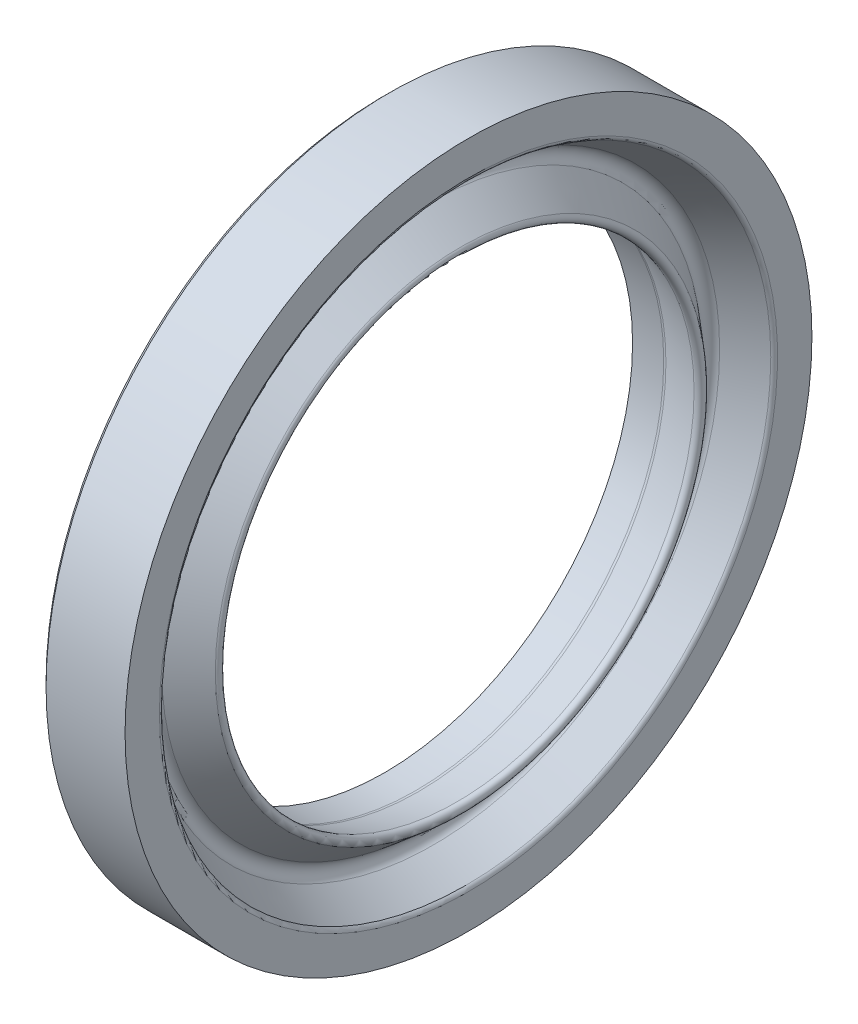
ISO-10303-21;
HEADER;
FILE_DESCRIPTION(('STEP AP214'),'2;1');
FILE_NAME('part.step','',(''),(''),'','','');
FILE_SCHEMA(('AUTOMOTIVE_DESIGN { 1 0 10303 214 1 1 1 1 }'));
ENDSEC;
DATA;
#1=APPLICATION_CONTEXT('core data for automotive mechanical design processes');
#2=APPLICATION_PROTOCOL_DEFINITION('international standard','automotive_design',2000,#1);
#3=PRODUCT_CONTEXT('',#1,'mechanical');
#4=PRODUCT('Part','Part','',(#3));
#5=PRODUCT_RELATED_PRODUCT_CATEGORY('part','',(#4));
#6=PRODUCT_DEFINITION_FORMATION('','',#4);
#7=PRODUCT_DEFINITION_CONTEXT('part definition',#1,'design');
#8=PRODUCT_DEFINITION('design','',#6,#7);
#9=PRODUCT_DEFINITION_SHAPE('','',#8);
#10=(LENGTH_UNIT() NAMED_UNIT(*) SI_UNIT(.MILLI.,.METRE.));
#11=(NAMED_UNIT(*) PLANE_ANGLE_UNIT() SI_UNIT($,.RADIAN.));
#12=(NAMED_UNIT(*) SI_UNIT($,.STERADIAN.) SOLID_ANGLE_UNIT());
#13=UNCERTAINTY_MEASURE_WITH_UNIT(LENGTH_MEASURE(1.E-05),#10,'distance_accuracy_value','');
#14=(GEOMETRIC_REPRESENTATION_CONTEXT(3) GLOBAL_UNCERTAINTY_ASSIGNED_CONTEXT((#13)) GLOBAL_UNIT_ASSIGNED_CONTEXT((#10,
#11,#12)) REPRESENTATION_CONTEXT('',''));
#15=CARTESIAN_POINT('',(0.,0.,0.));
#16=DIRECTION('',(0.,0.,1.));
#17=DIRECTION('',(1.,0.,0.));
#18=AXIS2_PLACEMENT_3D('',#15,#16,#17);
#19=CARTESIAN_POINT('',(10.3553652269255,0.,0.));
#20=DIRECTION('',(-1.,0.,0.));
#21=DIRECTION('',(0.,0.,1.));
#22=AXIS2_PLACEMENT_3D('',#19,#20,#21);
#23=TOROIDAL_SURFACE('',#22,40.4953832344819,0.644634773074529);
#24=CARTESIAN_POINT('',(10.6719865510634,0.,0.));
#25=DIRECTION('',(-1.,0.,0.));
#26=DIRECTION('',(0.,0.,1.));
#27=AXIS2_PLACEMENT_3D('',#24,#25,#26);
#28=CIRCLE('',#27,39.9338630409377);
#29=CARTESIAN_POINT('',(10.6719865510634,0.,39.9338630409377));
#30=VERTEX_POINT('',#29);
#31=EDGE_CURVE('E10',#30,#30,#28,.T.);
#32=ORIENTED_EDGE('',*,*,#31,.T.);
#33=EDGE_LOOP('',(#32));
#34=FACE_BOUND('',#33,.T.);
#35=CARTESIAN_POINT('',(11.,0.,0.));
#36=DIRECTION('',(-1.,0.,0.));
#37=DIRECTION('',(0.,0.,1.));
#38=AXIS2_PLACEMENT_3D('',#35,#36,#37);
#39=CIRCLE('',#38,40.4953832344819);
#40=CARTESIAN_POINT('',(11.,0.,40.4953832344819));
#41=VERTEX_POINT('',#40);
#42=EDGE_CURVE('E71',#41,#41,#39,.T.);
#43=ORIENTED_EDGE('',*,*,#42,.F.);
#44=EDGE_LOOP('',(#43));
#45=FACE_BOUND('',#44,.T.);
#46=ADVANCED_FACE('F31',(#34,#45),#23,.T.);
#47=CARTESIAN_POINT('',(10.6719865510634,0.,0.));
#48=DIRECTION('',(1.,0.,0.));
#49=DIRECTION('',(0.,0.,-1.));
#50=AXIS2_PLACEMENT_3D('',#47,#48,#49);
#51=CONICAL_SURFACE('',#50,39.9338630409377,0.513425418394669);
#52=CARTESIAN_POINT('',(6.38738178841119,0.,0.));
#53=DIRECTION('',(-1.,0.,0.));
#54=DIRECTION('',(0.,0.,1.));
#55=AXIS2_PLACEMENT_3D('',#52,#53,#54);
#56=CIRCLE('',#55,37.5179263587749);
#57=CARTESIAN_POINT('',(6.38738178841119,0.,37.5179263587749));
#58=VERTEX_POINT('',#57);
#59=EDGE_CURVE('E37',#58,#58,#56,.T.);
#60=ORIENTED_EDGE('',*,*,#59,.T.);
#61=EDGE_LOOP('',(#60));
#62=FACE_BOUND('',#61,.T.);
#63=ORIENTED_EDGE('',*,*,#31,.F.);
#64=EDGE_LOOP('',(#63));
#65=FACE_BOUND('',#64,.T.);
#66=ADVANCED_FACE('F79',(#62,#65),#51,.F.);
#67=CARTESIAN_POINT('',(7.02589484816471,0.,0.));
#68=DIRECTION('',(-1.,0.,0.));
#69=DIRECTION('',(0.,0.,1.));
#70=AXIS2_PLACEMENT_3D('',#67,#68,#69);
#71=TOROIDAL_SURFACE('',#70,36.3855390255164,1.29999999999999);
#72=CARTESIAN_POINT('',(6.1902709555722,0.,0.));
#73=DIRECTION('',(-1.,0.,0.));
#74=DIRECTION('',(0.,0.,1.));
#75=AXIS2_PLACEMENT_3D('',#72,#73,#74);
#76=CIRCLE('',#75,35.3896812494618);
#77=CARTESIAN_POINT('',(6.1902709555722,0.,35.3896812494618));
#78=VERTEX_POINT('',#77);
#79=EDGE_CURVE('E41',#78,#78,#76,.T.);
#80=ORIENTED_EDGE('',*,*,#79,.T.);
#81=EDGE_LOOP('',(#80));
#82=FACE_BOUND('',#81,.T.);
#83=ORIENTED_EDGE('',*,*,#59,.F.);
#84=EDGE_LOOP('',(#83));
#85=FACE_BOUND('',#84,.T.);
#86=ADVANCED_FACE('F83',(#82,#85),#71,.F.);
#87=CARTESIAN_POINT('',(6.1902709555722,0.,0.));
#88=DIRECTION('',(-1.,0.,0.));
#89=DIRECTION('',(0.,0.,1.));
#90=AXIS2_PLACEMENT_3D('',#87,#88,#89);
#91=CONICAL_SURFACE('',#90,35.3896812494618,0.698131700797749);
#92=CARTESIAN_POINT('',(10.0107731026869,0.,0.));
#93=DIRECTION('',(-1.,0.,0.));
#94=DIRECTION('',(0.,0.,1.));
#95=AXIS2_PLACEMENT_3D('',#92,#93,#94);
#96=CIRCLE('',#95,32.1838993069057);
#97=CARTESIAN_POINT('',(10.0107731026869,0.,32.1838993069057));
#98=VERTEX_POINT('',#97);
#99=EDGE_CURVE('E45',#98,#98,#96,.T.);
#100=ORIENTED_EDGE('',*,*,#99,.T.);
#101=EDGE_LOOP('',(#100));
#102=FACE_BOUND('',#101,.T.);
#103=ORIENTED_EDGE('',*,*,#79,.F.);
#104=EDGE_LOOP('',(#103));
#105=FACE_BOUND('',#104,.T.);
#106=ADVANCED_FACE('F87',(#102,#105),#91,.T.);
#107=CARTESIAN_POINT('',(9.61097791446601,0.,0.));
#108=DIRECTION('',(-1.,0.,0.));
#109=DIRECTION('',(0.,0.,1.));
#110=AXIS2_PLACEMENT_3D('',#107,#108,#109);
#111=TOROIDAL_SURFACE('',#110,31.7074419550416,0.621970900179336);
#112=CARTESIAN_POINT('',(9.45000000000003,0.,0.));
#113=DIRECTION('',(-1.,0.,0.));
#114=DIRECTION('',(0.,0.,1.));
#115=AXIS2_PLACEMENT_3D('',#112,#113,#114);
#116=CIRCLE('',#115,31.1066641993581);
#117=CARTESIAN_POINT('',(9.45000000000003,0.,31.1066641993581));
#118=VERTEX_POINT('',#117);
#119=EDGE_CURVE('E50',#118,#118,#116,.T.);
#120=ORIENTED_EDGE('',*,*,#119,.T.);
#121=EDGE_LOOP('',(#120));
#122=FACE_BOUND('',#121,.T.);
#123=ORIENTED_EDGE('',*,*,#99,.F.);
#124=EDGE_LOOP('',(#123));
#125=FACE_BOUND('',#124,.T.);
#126=ADVANCED_FACE('F94',(#122,#125),#111,.T.);
#127=CARTESIAN_POINT('',(9.45000000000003,0.,0.));
#128=DIRECTION('',(-1.,0.,0.));
#129=DIRECTION('',(0.,0.,1.));
#130=AXIS2_PLACEMENT_3D('',#127,#128,#129);
#131=CONICAL_SURFACE('',#130,31.1066641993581,0.261799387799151);
#132=CARTESIAN_POINT('',(4.41531651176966,0.,0.));
#133=DIRECTION('',(-1.,0.,0.));
#134=DIRECTION('',(0.,0.,1.));
#135=AXIS2_PLACEMENT_3D('',#132,#133,#134);
#136=CIRCLE('',#135,32.4557035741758);
#137=CARTESIAN_POINT('',(4.41531651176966,0.,32.4557035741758));
#138=VERTEX_POINT('',#137);
#139=EDGE_CURVE('E53',#138,#138,#136,.T.);
#140=ORIENTED_EDGE('',*,*,#139,.T.);
#141=EDGE_LOOP('',(#140));
#142=FACE_BOUND('',#141,.T.);
#143=ORIENTED_EDGE('',*,*,#119,.F.);
#144=EDGE_LOOP('',(#143));
#145=FACE_BOUND('',#144,.T.);
#146=ADVANCED_FACE('F98',(#142,#145),#131,.F.);
#147=CARTESIAN_POINT('',(4.07885175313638,0.,0.));
#148=DIRECTION('',(-1.,0.,0.));
#149=DIRECTION('',(0.,0.,1.));
#150=AXIS2_PLACEMENT_3D('',#147,#148,#149);
#151=TOROIDAL_SURFACE('',#150,31.2,1.29999999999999);
#152=CARTESIAN_POINT('',(4.07885175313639,0.,0.));
#153=DIRECTION('',(-1.,0.,0.));
#154=DIRECTION('',(0.,0.,1.));
#155=AXIS2_PLACEMENT_3D('',#152,#153,#154);
#156=CIRCLE('',#155,32.5);
#157=CARTESIAN_POINT('',(4.07885175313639,0.,32.5));
#158=VERTEX_POINT('',#157);
#159=EDGE_CURVE('E56',#158,#158,#156,.T.);
#160=ORIENTED_EDGE('',*,*,#159,.T.);
#161=EDGE_LOOP('',(#160));
#162=FACE_BOUND('',#161,.T.);
#163=ORIENTED_EDGE('',*,*,#139,.F.);
#164=EDGE_LOOP('',(#163));
#165=FACE_BOUND('',#164,.T.);
#166=ADVANCED_FACE('F102',(#162,#165),#151,.F.);
#167=CARTESIAN_POINT('',(-33.896256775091,0.,0.));
#168=DIRECTION('',(-1.,0.,0.));
#169=DIRECTION('',(0.,0.,1.));
#170=AXIS2_PLACEMENT_3D('',#167,#168,#169);
#171=CYLINDRICAL_SURFACE('',#170,32.5);
#172=CARTESIAN_POINT('',(0.,0.,0.));
#173=DIRECTION('',(-1.,0.,0.));
#174=DIRECTION('',(0.,0.,1.));
#175=AXIS2_PLACEMENT_3D('',#172,#173,#174);
#176=CIRCLE('',#175,32.5);
#177=CARTESIAN_POINT('',(0.,0.,32.5));
#178=VERTEX_POINT('',#177);
#179=EDGE_CURVE('E59',#178,#178,#176,.T.);
#180=ORIENTED_EDGE('',*,*,#179,.T.);
#181=EDGE_LOOP('',(#180));
#182=FACE_BOUND('',#181,.T.);
#183=ORIENTED_EDGE('',*,*,#159,.F.);
#184=EDGE_LOOP('',(#183));
#185=FACE_BOUND('',#184,.T.);
#186=ADVANCED_FACE('F106',(#182,#185),#171,.F.);
#187=CARTESIAN_POINT('',(0.,-44.35,0.));
#188=DIRECTION('',(-1.,0.,0.));
#189=DIRECTION('',(0.,0.,1.));
#190=AXIS2_PLACEMENT_3D('',#187,#188,#189);
#191=PLANE('',#190);
#192=CARTESIAN_POINT('',(0.,0.,0.));
#193=DIRECTION('',(-1.,0.,0.));
#194=DIRECTION('',(0.,0.,1.));
#195=AXIS2_PLACEMENT_3D('',#192,#193,#194);
#196=CIRCLE('',#195,44.35);
#197=CARTESIAN_POINT('',(0.,0.,44.35));
#198=VERTEX_POINT('',#197);
#199=EDGE_CURVE('E62',#198,#198,#196,.T.);
#200=ORIENTED_EDGE('',*,*,#199,.T.);
#201=EDGE_LOOP('',(#200));
#202=FACE_BOUND('',#201,.T.);
#203=ORIENTED_EDGE('',*,*,#179,.F.);
#204=EDGE_LOOP('',(#203));
#205=FACE_BOUND('',#204,.T.);
#206=ADVANCED_FACE('F110',(#202,#205),#191,.T.);
#207=CARTESIAN_POINT('',(0.,0.,0.));
#208=DIRECTION('',(1.,0.,0.));
#209=DIRECTION('',(0.,0.,-1.));
#210=AXIS2_PLACEMENT_3D('',#207,#208,#209);
#211=CONICAL_SURFACE('',#210,44.35,0.785398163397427);
#212=CARTESIAN_POINT('',(0.650000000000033,0.,0.));
#213=DIRECTION('',(-1.,0.,0.));
#214=DIRECTION('',(0.,0.,1.));
#215=AXIS2_PLACEMENT_3D('',#212,#213,#214);
#216=CIRCLE('',#215,45.);
#217=CARTESIAN_POINT('',(0.650000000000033,0.,45.));
#218=VERTEX_POINT('',#217);
#219=EDGE_CURVE('E65',#218,#218,#216,.T.);
#220=ORIENTED_EDGE('',*,*,#219,.T.);
#221=EDGE_LOOP('',(#220));
#222=FACE_BOUND('',#221,.T.);
#223=ORIENTED_EDGE('',*,*,#199,.F.);
#224=EDGE_LOOP('',(#223));
#225=FACE_BOUND('',#224,.T.);
#226=ADVANCED_FACE('F114',(#222,#225),#211,.T.);
#227=CARTESIAN_POINT('',(-33.896256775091,0.,0.));
#228=DIRECTION('',(-1.,0.,0.));
#229=DIRECTION('',(0.,0.,1.));
#230=AXIS2_PLACEMENT_3D('',#227,#228,#229);
#231=CYLINDRICAL_SURFACE('',#230,45.);
#232=CARTESIAN_POINT('',(11.,0.,0.));
#233=DIRECTION('',(-1.,0.,0.));
#234=DIRECTION('',(0.,0.,1.));
#235=AXIS2_PLACEMENT_3D('',#232,#233,#234);
#236=CIRCLE('',#235,45.);
#237=CARTESIAN_POINT('',(11.,0.,45.));
#238=VERTEX_POINT('',#237);
#239=EDGE_CURVE('E68',#238,#238,#236,.T.);
#240=ORIENTED_EDGE('',*,*,#239,.T.);
#241=EDGE_LOOP('',(#240));
#242=FACE_BOUND('',#241,.T.);
#243=ORIENTED_EDGE('',*,*,#219,.F.);
#244=EDGE_LOOP('',(#243));
#245=FACE_BOUND('',#244,.T.);
#246=ADVANCED_FACE('F118',(#242,#245),#231,.T.);
#247=CARTESIAN_POINT('',(11.,-45.,0.));
#248=DIRECTION('',(1.,0.,0.));
#249=DIRECTION('',(0.,0.,-1.));
#250=AXIS2_PLACEMENT_3D('',#247,#248,#249);
#251=PLANE('',#250);
#252=ORIENTED_EDGE('',*,*,#42,.T.);
#253=EDGE_LOOP('',(#252));
#254=FACE_BOUND('',#253,.T.);
#255=ORIENTED_EDGE('',*,*,#239,.F.);
#256=EDGE_LOOP('',(#255));
#257=FACE_BOUND('',#256,.T.);
#258=ADVANCED_FACE('F75',(#254,#257),#251,.T.);
#259=CLOSED_SHELL('',(#46,#66,#86,#106,#126,#146,#166,#186,#206,#226,#246,#258));
#260=MANIFOLD_SOLID_BREP('B2',#259);
#261=ADVANCED_BREP_SHAPE_REPRESENTATION('',(#18,#260),#14);
#262=SHAPE_DEFINITION_REPRESENTATION(#9,#261);
ENDSEC;
END-ISO-10303-21;
